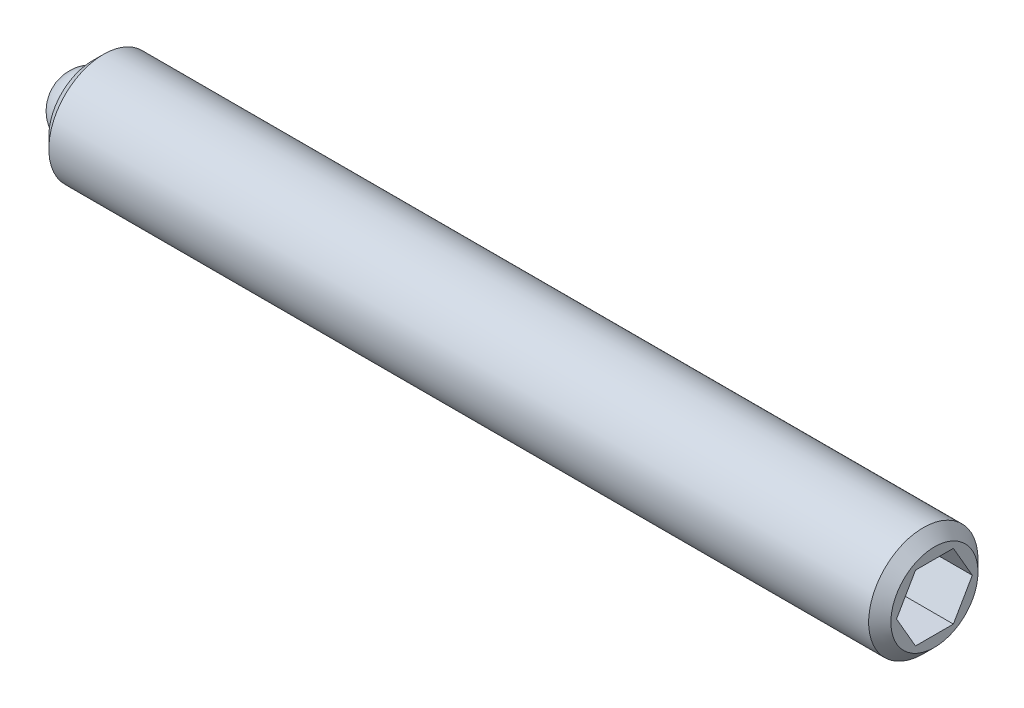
ISO-10303-21;
HEADER;
FILE_DESCRIPTION(('STEP AP214'),'2;1');
FILE_NAME('part.step','',(''),(''),'','','');
FILE_SCHEMA(('AUTOMOTIVE_DESIGN { 1 0 10303 214 1 1 1 1 }'));
ENDSEC;
DATA;
#1=APPLICATION_CONTEXT('core data for automotive mechanical design processes');
#2=APPLICATION_PROTOCOL_DEFINITION('international standard','automotive_design',2000,#1);
#3=PRODUCT_CONTEXT('',#1,'mechanical');
#4=PRODUCT('Part','Part','',(#3));
#5=PRODUCT_RELATED_PRODUCT_CATEGORY('part','',(#4));
#6=PRODUCT_DEFINITION_FORMATION('','',#4);
#7=PRODUCT_DEFINITION_CONTEXT('part definition',#1,'design');
#8=PRODUCT_DEFINITION('design','',#6,#7);
#9=PRODUCT_DEFINITION_SHAPE('','',#8);
#10=(LENGTH_UNIT() NAMED_UNIT(*) SI_UNIT(.MILLI.,.METRE.));
#11=(NAMED_UNIT(*) PLANE_ANGLE_UNIT() SI_UNIT($,.RADIAN.));
#12=(NAMED_UNIT(*) SI_UNIT($,.STERADIAN.) SOLID_ANGLE_UNIT());
#13=UNCERTAINTY_MEASURE_WITH_UNIT(LENGTH_MEASURE(1.E-05),#10,'distance_accuracy_value','');
#14=(GEOMETRIC_REPRESENTATION_CONTEXT(3) GLOBAL_UNCERTAINTY_ASSIGNED_CONTEXT((#13)) GLOBAL_UNIT_ASSIGNED_CONTEXT((#10,
#11,#12)) REPRESENTATION_CONTEXT('',''));
#15=CARTESIAN_POINT('',(0.,0.,0.));
#16=DIRECTION('',(0.,0.,1.));
#17=DIRECTION('',(1.,0.,0.));
#18=AXIS2_PLACEMENT_3D('',#15,#16,#17);
#19=CARTESIAN_POINT('',(0.,0.,0.));
#20=DIRECTION('',(0.,-1.,0.));
#21=DIRECTION('',(0.,0.,-1.));
#22=AXIS2_PLACEMENT_3D('',#19,#20,#21);
#23=SPHERICAL_SURFACE('',#22,0.75);
#24=CARTESIAN_POINT('',(0.,-0.75,0.));
#25=VERTEX_POINT('',#24);
#26=VERTEX_LOOP('',#25);
#27=FACE_BOUND('',#26,.T.);
#28=ADVANCED_FACE('F43',(#27),#23,.T.);
#29=CLOSED_SHELL('',(#28));
#30=MANIFOLD_SOLID_BREP('B2',#29);
#31=CARTESIAN_POINT('',(19.25,0.,0.));
#32=DIRECTION('',(-1.,0.,0.));
#33=DIRECTION('',(0.,0.,1.));
#34=AXIS2_PLACEMENT_3D('',#31,#32,#33);
#35=CYLINDRICAL_SURFACE('',#34,1.25);
#36=CARTESIAN_POINT('',(18.996,0.,0.));
#37=DIRECTION('',(1.,0.,0.));
#38=DIRECTION('',(0.,0.,-1.));
#39=AXIS2_PLACEMENT_3D('',#36,#37,#38);
#40=CIRCLE('',#39,1.25);
#41=CARTESIAN_POINT('',(18.996,0.,-1.25));
#42=VERTEX_POINT('',#41);
#43=EDGE_CURVE('E41',#42,#42,#40,.F.);
#44=ORIENTED_EDGE('',*,*,#43,.T.);
#45=EDGE_LOOP('',(#44));
#46=FACE_BOUND('',#45,.T.);
#47=CARTESIAN_POINT('',(0.253999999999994,0.,0.));
#48=DIRECTION('',(1.,0.,0.));
#49=DIRECTION('',(0.,0.,-1.));
#50=AXIS2_PLACEMENT_3D('',#47,#48,#49);
#51=CIRCLE('',#50,1.25);
#52=CARTESIAN_POINT('',(0.253999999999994,0.,-1.25));
#53=VERTEX_POINT('',#52);
#54=EDGE_CURVE('E159',#53,#53,#51,.T.);
#55=ORIENTED_EDGE('',*,*,#54,.T.);
#56=EDGE_LOOP('',(#55));
#57=FACE_BOUND('',#56,.T.);
#58=ADVANCED_FACE('F56',(#46,#57),#35,.T.);
#59=CARTESIAN_POINT('',(19.25,0.,0.));
#60=DIRECTION('',(1.,0.,0.));
#61=DIRECTION('',(0.,0.,-1.));
#62=AXIS2_PLACEMENT_3D('',#59,#60,#61);
#63=PLANE('',#62);
#64=DIRECTION('',(0.,0.866025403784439,-0.5));
#65=VECTOR('',#64,1.);
#66=CARTESIAN_POINT('',(19.25,-0.75,-0.43301270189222));
#67=LINE('',#66,#65);
#68=CARTESIAN_POINT('',(19.25,-0.75,-0.43301270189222));
#69=VERTEX_POINT('',#68);
#70=CARTESIAN_POINT('',(19.25,0.,-0.866025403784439));
#71=VERTEX_POINT('',#70);
#72=EDGE_CURVE('E71',#69,#71,#67,.T.);
#73=ORIENTED_EDGE('',*,*,#72,.F.);
#74=DIRECTION('',(0.,0.,-1.));
#75=VECTOR('',#74,1.);
#76=CARTESIAN_POINT('',(19.25,-0.75,0.433012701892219));
#77=LINE('',#76,#75);
#78=CARTESIAN_POINT('',(19.25,-0.75,0.433012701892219));
#79=VERTEX_POINT('',#78);
#80=EDGE_CURVE('E155',#79,#69,#77,.T.);
#81=ORIENTED_EDGE('',*,*,#80,.F.);
#82=DIRECTION('',(0.,-0.866025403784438,-0.5));
#83=VECTOR('',#82,1.);
#84=CARTESIAN_POINT('',(19.25,0.,0.866025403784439));
#85=LINE('',#84,#83);
#86=CARTESIAN_POINT('',(19.25,0.,0.866025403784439));
#87=VERTEX_POINT('',#86);
#88=EDGE_CURVE('E153',#87,#79,#85,.T.);
#89=ORIENTED_EDGE('',*,*,#88,.F.);
#90=DIRECTION('',(0.,-0.866025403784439,0.5));
#91=VECTOR('',#90,1.);
#92=CARTESIAN_POINT('',(19.25,0.75,0.433012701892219));
#93=LINE('',#92,#91);
#94=CARTESIAN_POINT('',(19.25,0.75,0.433012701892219));
#95=VERTEX_POINT('',#94);
#96=EDGE_CURVE('E119',#95,#87,#93,.T.);
#97=ORIENTED_EDGE('',*,*,#96,.F.);
#98=DIRECTION('',(0.,0.,1.));
#99=VECTOR('',#98,1.);
#100=CARTESIAN_POINT('',(19.25,0.75,-0.433012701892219));
#101=LINE('',#100,#99);
#102=CARTESIAN_POINT('',(19.25,0.75,-0.433012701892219));
#103=VERTEX_POINT('',#102);
#104=EDGE_CURVE('E149',#103,#95,#101,.T.);
#105=ORIENTED_EDGE('',*,*,#104,.F.);
#106=DIRECTION('',(0.,0.866025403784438,0.5));
#107=VECTOR('',#106,1.);
#108=CARTESIAN_POINT('',(19.25,0.,-0.866025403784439));
#109=LINE('',#108,#107);
#110=EDGE_CURVE('E145',#71,#103,#109,.T.);
#111=ORIENTED_EDGE('',*,*,#110,.F.);
#112=EDGE_LOOP('',(#73,#81,#89,#97,#105,#111));
#113=FACE_BOUND('',#112,.T.);
#114=CARTESIAN_POINT('',(19.25,0.,0.));
#115=DIRECTION('',(1.,0.,0.));
#116=DIRECTION('',(0.,0.,-1.));
#117=AXIS2_PLACEMENT_3D('',#114,#115,#116);
#118=CIRCLE('',#117,0.995999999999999);
#119=CARTESIAN_POINT('',(19.25,0.,-0.995999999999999));
#120=VERTEX_POINT('',#119);
#121=EDGE_CURVE('E64',#120,#120,#118,.T.);
#122=ORIENTED_EDGE('',*,*,#121,.T.);
#123=EDGE_LOOP('',(#122));
#124=FACE_BOUND('',#123,.T.);
#125=ADVANCED_FACE('F172',(#113,#124),#63,.T.);
#126=CARTESIAN_POINT('',(0.,0.,0.));
#127=DIRECTION('',(1.,0.,0.));
#128=DIRECTION('',(0.,0.,-1.));
#129=AXIS2_PLACEMENT_3D('',#126,#127,#128);
#130=PLANE('',#129);
#131=CARTESIAN_POINT('',(0.,0.,0.));
#132=DIRECTION('',(-1.,0.,0.));
#133=DIRECTION('',(0.,0.,1.));
#134=AXIS2_PLACEMENT_3D('',#131,#132,#133);
#135=CIRCLE('',#134,0.75);
#136=CARTESIAN_POINT('',(0.,0.,0.75));
#137=VERTEX_POINT('',#136);
#138=EDGE_CURVE('E227',#137,#137,#135,.T.);
#139=ORIENTED_EDGE('',*,*,#138,.F.);
#140=EDGE_LOOP('',(#139));
#141=FACE_BOUND('',#140,.T.);
#142=CARTESIAN_POINT('',(0.,0.,0.));
#143=DIRECTION('',(1.,0.,0.));
#144=DIRECTION('',(0.,0.,-1.));
#145=AXIS2_PLACEMENT_3D('',#142,#143,#144);
#146=CIRCLE('',#145,0.996000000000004);
#147=CARTESIAN_POINT('',(0.,0.,-0.996000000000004));
#148=VERTEX_POINT('',#147);
#149=EDGE_CURVE('E167',#148,#148,#146,.F.);
#150=ORIENTED_EDGE('',*,*,#149,.T.);
#151=EDGE_LOOP('',(#150));
#152=FACE_BOUND('',#151,.T.);
#153=ADVANCED_FACE('F184',(#141,#152),#130,.F.);
#154=CARTESIAN_POINT('',(0.253999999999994,0.,0.));
#155=DIRECTION('',(1.,0.,0.));
#156=DIRECTION('',(0.,0.,-1.));
#157=AXIS2_PLACEMENT_3D('',#154,#155,#156);
#158=CONICAL_SURFACE('',#157,1.25,0.785398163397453);
#159=ORIENTED_EDGE('',*,*,#149,.F.);
#160=EDGE_LOOP('',(#159));
#161=FACE_BOUND('',#160,.T.);
#162=ORIENTED_EDGE('',*,*,#54,.F.);
#163=EDGE_LOOP('',(#162));
#164=FACE_BOUND('',#163,.T.);
#165=ADVANCED_FACE('F176',(#161,#164),#158,.T.);
#166=CARTESIAN_POINT('',(19.25,0.,0.));
#167=DIRECTION('',(-1.,0.,0.));
#168=DIRECTION('',(0.,0.,1.));
#169=AXIS2_PLACEMENT_3D('',#166,#167,#168);
#170=CONICAL_SURFACE('',#169,0.995999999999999,0.785398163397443);
#171=ORIENTED_EDGE('',*,*,#43,.F.);
#172=EDGE_LOOP('',(#171));
#173=FACE_BOUND('',#172,.T.);
#174=ORIENTED_EDGE('',*,*,#121,.F.);
#175=EDGE_LOOP('',(#174));
#176=FACE_BOUND('',#175,.T.);
#177=ADVANCED_FACE('F58',(#173,#176),#170,.T.);
#178=CARTESIAN_POINT('',(17.25,-0.75,-0.43301270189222));
#179=DIRECTION('',(0.,-0.5,-0.866025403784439));
#180=DIRECTION('',(0.,0.866025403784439,-0.5));
#181=AXIS2_PLACEMENT_3D('',#178,#179,#180);
#182=PLANE('',#181);
#183=ORIENTED_EDGE('',*,*,#72,.T.);
#184=DIRECTION('',(1.,0.,0.));
#185=VECTOR('',#184,1.);
#186=CARTESIAN_POINT('',(17.25,0.,-0.866025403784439));
#187=LINE('',#186,#185);
#188=CARTESIAN_POINT('',(17.25,0.,-0.866025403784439));
#189=VERTEX_POINT('',#188);
#190=EDGE_CURVE('E101',#189,#71,#187,.T.);
#191=ORIENTED_EDGE('',*,*,#190,.F.);
#192=DIRECTION('',(0.,0.866025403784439,-0.5));
#193=VECTOR('',#192,1.);
#194=CARTESIAN_POINT('',(17.25,-0.75,-0.43301270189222));
#195=LINE('',#194,#193);
#196=CARTESIAN_POINT('',(17.25,-0.75,-0.43301270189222));
#197=VERTEX_POINT('',#196);
#198=EDGE_CURVE('E157',#197,#189,#195,.T.);
#199=ORIENTED_EDGE('',*,*,#198,.F.);
#200=DIRECTION('',(1.,0.,0.));
#201=VECTOR('',#200,1.);
#202=CARTESIAN_POINT('',(17.25,-0.75,-0.43301270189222));
#203=LINE('',#202,#201);
#204=EDGE_CURVE('E79',#197,#69,#203,.T.);
#205=ORIENTED_EDGE('',*,*,#204,.T.);
#206=EDGE_LOOP('',(#183,#191,#199,#205));
#207=FACE_BOUND('',#206,.T.);
#208=ADVANCED_FACE('F175',(#207),#182,.F.);
#209=CARTESIAN_POINT('',(17.25,-0.75,0.433012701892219));
#210=DIRECTION('',(0.,-1.,0.));
#211=DIRECTION('',(0.,0.,-1.));
#212=AXIS2_PLACEMENT_3D('',#209,#210,#211);
#213=PLANE('',#212);
#214=ORIENTED_EDGE('',*,*,#80,.T.);
#215=ORIENTED_EDGE('',*,*,#204,.F.);
#216=DIRECTION('',(0.,0.,-1.));
#217=VECTOR('',#216,1.);
#218=CARTESIAN_POINT('',(17.25,-0.75,0.433012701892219));
#219=LINE('',#218,#217);
#220=CARTESIAN_POINT('',(17.25,-0.75,0.433012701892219));
#221=VERTEX_POINT('',#220);
#222=EDGE_CURVE('E131',#221,#197,#219,.T.);
#223=ORIENTED_EDGE('',*,*,#222,.F.);
#224=DIRECTION('',(1.,0.,0.));
#225=VECTOR('',#224,1.);
#226=CARTESIAN_POINT('',(17.25,-0.75,0.433012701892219));
#227=LINE('',#226,#225);
#228=EDGE_CURVE('E123',#221,#79,#227,.T.);
#229=ORIENTED_EDGE('',*,*,#228,.T.);
#230=EDGE_LOOP('',(#214,#215,#223,#229));
#231=FACE_BOUND('',#230,.T.);
#232=ADVANCED_FACE('F182',(#231),#213,.F.);
#233=CARTESIAN_POINT('',(17.25,0.,0.866025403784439));
#234=DIRECTION('',(0.,-0.5,0.866025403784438));
#235=DIRECTION('',(0.,-0.866025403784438,-0.5));
#236=AXIS2_PLACEMENT_3D('',#233,#234,#235);
#237=PLANE('',#236);
#238=ORIENTED_EDGE('',*,*,#88,.T.);
#239=ORIENTED_EDGE('',*,*,#228,.F.);
#240=DIRECTION('',(0.,-0.866025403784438,-0.5));
#241=VECTOR('',#240,1.);
#242=CARTESIAN_POINT('',(17.25,0.,0.866025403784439));
#243=LINE('',#242,#241);
#244=CARTESIAN_POINT('',(17.25,0.,0.866025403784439));
#245=VERTEX_POINT('',#244);
#246=EDGE_CURVE('E127',#245,#221,#243,.T.);
#247=ORIENTED_EDGE('',*,*,#246,.F.);
#248=DIRECTION('',(1.,0.,0.));
#249=VECTOR('',#248,1.);
#250=CARTESIAN_POINT('',(17.25,0.,0.866025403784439));
#251=LINE('',#250,#249);
#252=EDGE_CURVE('E112',#245,#87,#251,.T.);
#253=ORIENTED_EDGE('',*,*,#252,.T.);
#254=EDGE_LOOP('',(#238,#239,#247,#253));
#255=FACE_BOUND('',#254,.T.);
#256=ADVANCED_FACE('F128',(#255),#237,.F.);
#257=CARTESIAN_POINT('',(17.25,0.75,0.433012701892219));
#258=DIRECTION('',(0.,0.5,0.866025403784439));
#259=DIRECTION('',(0.,-0.866025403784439,0.5));
#260=AXIS2_PLACEMENT_3D('',#257,#258,#259);
#261=PLANE('',#260);
#262=ORIENTED_EDGE('',*,*,#96,.T.);
#263=ORIENTED_EDGE('',*,*,#252,.F.);
#264=DIRECTION('',(0.,-0.866025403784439,0.5));
#265=VECTOR('',#264,1.);
#266=CARTESIAN_POINT('',(17.25,0.75,0.433012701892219));
#267=LINE('',#266,#265);
#268=CARTESIAN_POINT('',(17.25,0.75,0.433012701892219));
#269=VERTEX_POINT('',#268);
#270=EDGE_CURVE('E116',#269,#245,#267,.T.);
#271=ORIENTED_EDGE('',*,*,#270,.F.);
#272=DIRECTION('',(1.,0.,0.));
#273=VECTOR('',#272,1.);
#274=CARTESIAN_POINT('',(17.25,0.75,0.433012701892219));
#275=LINE('',#274,#273);
#276=EDGE_CURVE('E124',#269,#95,#275,.T.);
#277=ORIENTED_EDGE('',*,*,#276,.T.);
#278=EDGE_LOOP('',(#262,#263,#271,#277));
#279=FACE_BOUND('',#278,.T.);
#280=ADVANCED_FACE('F114',(#279),#261,.F.);
#281=CARTESIAN_POINT('',(17.25,0.75,-0.433012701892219));
#282=DIRECTION('',(0.,1.,0.));
#283=DIRECTION('',(0.,0.,1.));
#284=AXIS2_PLACEMENT_3D('',#281,#282,#283);
#285=PLANE('',#284);
#286=ORIENTED_EDGE('',*,*,#104,.T.);
#287=ORIENTED_EDGE('',*,*,#276,.F.);
#288=DIRECTION('',(0.,0.,1.));
#289=VECTOR('',#288,1.);
#290=CARTESIAN_POINT('',(17.25,0.75,-0.433012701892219));
#291=LINE('',#290,#289);
#292=CARTESIAN_POINT('',(17.25,0.75,-0.433012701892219));
#293=VERTEX_POINT('',#292);
#294=EDGE_CURVE('E137',#293,#269,#291,.T.);
#295=ORIENTED_EDGE('',*,*,#294,.F.);
#296=DIRECTION('',(1.,0.,0.));
#297=VECTOR('',#296,1.);
#298=CARTESIAN_POINT('',(17.25,0.75,-0.433012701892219));
#299=LINE('',#298,#297);
#300=EDGE_CURVE('E162',#293,#103,#299,.T.);
#301=ORIENTED_EDGE('',*,*,#300,.T.);
#302=EDGE_LOOP('',(#286,#287,#295,#301));
#303=FACE_BOUND('',#302,.T.);
#304=ADVANCED_FACE('F203',(#303),#285,.F.);
#305=CARTESIAN_POINT('',(17.25,0.,-0.866025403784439));
#306=DIRECTION('',(0.,0.500000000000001,-0.866025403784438));
#307=DIRECTION('',(0.,0.866025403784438,0.500000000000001));
#308=AXIS2_PLACEMENT_3D('',#305,#306,#307);
#309=PLANE('',#308);
#310=ORIENTED_EDGE('',*,*,#110,.T.);
#311=ORIENTED_EDGE('',*,*,#300,.F.);
#312=DIRECTION('',(0.,0.866025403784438,0.5));
#313=VECTOR('',#312,1.);
#314=CARTESIAN_POINT('',(17.25,0.,-0.866025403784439));
#315=LINE('',#314,#313);
#316=EDGE_CURVE('E139',#189,#293,#315,.T.);
#317=ORIENTED_EDGE('',*,*,#316,.F.);
#318=ORIENTED_EDGE('',*,*,#190,.T.);
#319=EDGE_LOOP('',(#310,#311,#317,#318));
#320=FACE_BOUND('',#319,.T.);
#321=ADVANCED_FACE('F200',(#320),#309,.F.);
#322=CARTESIAN_POINT('',(17.25,0.,0.));
#323=DIRECTION('',(1.,0.,0.));
#324=DIRECTION('',(0.,0.,-1.));
#325=AXIS2_PLACEMENT_3D('',#322,#323,#324);
#326=PLANE('',#325);
#327=ORIENTED_EDGE('',*,*,#198,.T.);
#328=ORIENTED_EDGE('',*,*,#316,.T.);
#329=ORIENTED_EDGE('',*,*,#294,.T.);
#330=ORIENTED_EDGE('',*,*,#270,.T.);
#331=ORIENTED_EDGE('',*,*,#246,.T.);
#332=ORIENTED_EDGE('',*,*,#222,.T.);
#333=EDGE_LOOP('',(#327,#328,#329,#330,#331,#332));
#334=FACE_BOUND('',#333,.T.);
#335=ADVANCED_FACE('F134',(#334),#326,.T.);
#336=CARTESIAN_POINT('',(0.8,0.,0.));
#337=DIRECTION('',(-1.,0.,0.));
#338=DIRECTION('',(0.,0.,1.));
#339=AXIS2_PLACEMENT_3D('',#336,#337,#338);
#340=CYLINDRICAL_SURFACE('',#339,0.75);
#341=CARTESIAN_POINT('',(0.8,0.,0.));
#342=DIRECTION('',(-1.,0.,0.));
#343=DIRECTION('',(0.,0.,1.));
#344=AXIS2_PLACEMENT_3D('',#341,#342,#343);
#345=CIRCLE('',#344,0.75);
#346=CARTESIAN_POINT('',(0.8,0.,0.75));
#347=VERTEX_POINT('',#346);
#348=EDGE_CURVE('E146',#347,#347,#345,.T.);
#349=ORIENTED_EDGE('',*,*,#348,.F.);
#350=EDGE_LOOP('',(#349));
#351=FACE_BOUND('',#350,.T.);
#352=ORIENTED_EDGE('',*,*,#138,.T.);
#353=EDGE_LOOP('',(#352));
#354=FACE_BOUND('',#353,.T.);
#355=ADVANCED_FACE('F216',(#351,#354),#340,.F.);
#356=CARTESIAN_POINT('',(0.8,0.,0.));
#357=DIRECTION('',(-1.,0.,0.));
#358=DIRECTION('',(0.,0.,1.));
#359=AXIS2_PLACEMENT_3D('',#356,#357,#358);
#360=PLANE('',#359);
#361=ORIENTED_EDGE('',*,*,#348,.T.);
#362=EDGE_LOOP('',(#361));
#363=FACE_BOUND('',#362,.T.);
#364=ADVANCED_FACE('F219',(#363),#360,.T.);
#365=CLOSED_SHELL('',(#58,#125,#153,#165,#177,#208,#232,#256,#280,#304,#321,#335,#355,#364));
#366=MANIFOLD_SOLID_BREP('B6',#365);
#367=ADVANCED_BREP_SHAPE_REPRESENTATION('',(#18,#30,#366),#14);
#368=SHAPE_DEFINITION_REPRESENTATION(#9,#367);
ENDSEC;
END-ISO-10303-21;
